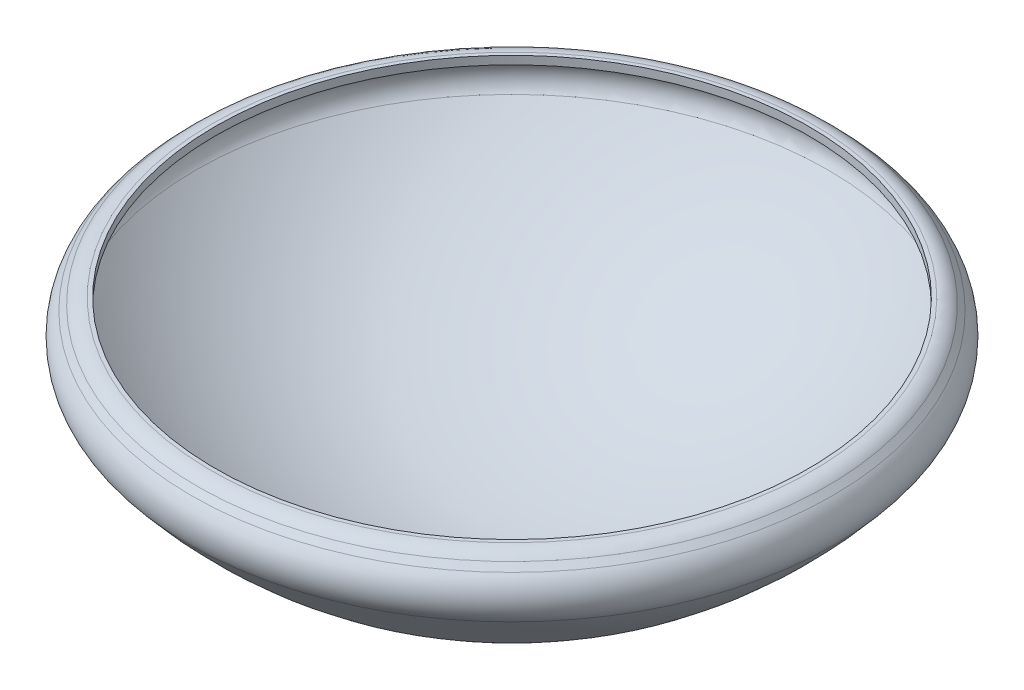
from build123d import *


with BuildPart() as part:
    # Esquisse1 → R_vol.-Mince3 (revolve)
    with BuildSketch(Plane.XY, mode=Mode.PRIVATE) as r_vol_mince3_sk:
        with BuildLine():
            Line((7.2, 0), (7.292893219, 0))
            ThreePointArc((7.292893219, 0), (7.484234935, -0.038060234), (7.646446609, -0.146446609))
            Line((7.646446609, -0.146446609), (7.780330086, -0.280330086))
            ThreePointArc((7.780330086, -0.280330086), (7.999053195, -0.772986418), (7.83086528, -1.285102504))
            ThreePointArc((7.83086528, -1.285102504), (4.333673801, -4.02418801), (0, -5))
            Line((0, -5), (0, -4.8))
            ThreePointArc((0, -4.8), (4.247952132, -3.843489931), (7.675967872, -1.158584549))
            ThreePointArc((7.675967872, -1.158584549), (7.799305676, -0.783032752), (7.63890873, -0.421751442))
            Line((7.63890873, -0.421751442), (7.505025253, -0.287867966))
            ThreePointArc((7.505025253, -0.287867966), (7.407698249, -0.22283614), (7.292893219, -0.2))
            Line((7.292893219, -0.2), (7.2, -0.2))
            Line((7.2, -0.2), (7.2, 0))
        make_face()
    revolve(r_vol_mince3_sk.sketch.rotate(Axis((0, 3.106939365, 0), (0, -1, 0)), 180), axis=Axis((0, 3.106939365, 0), (0, -1, 0)))


solid = part.part
